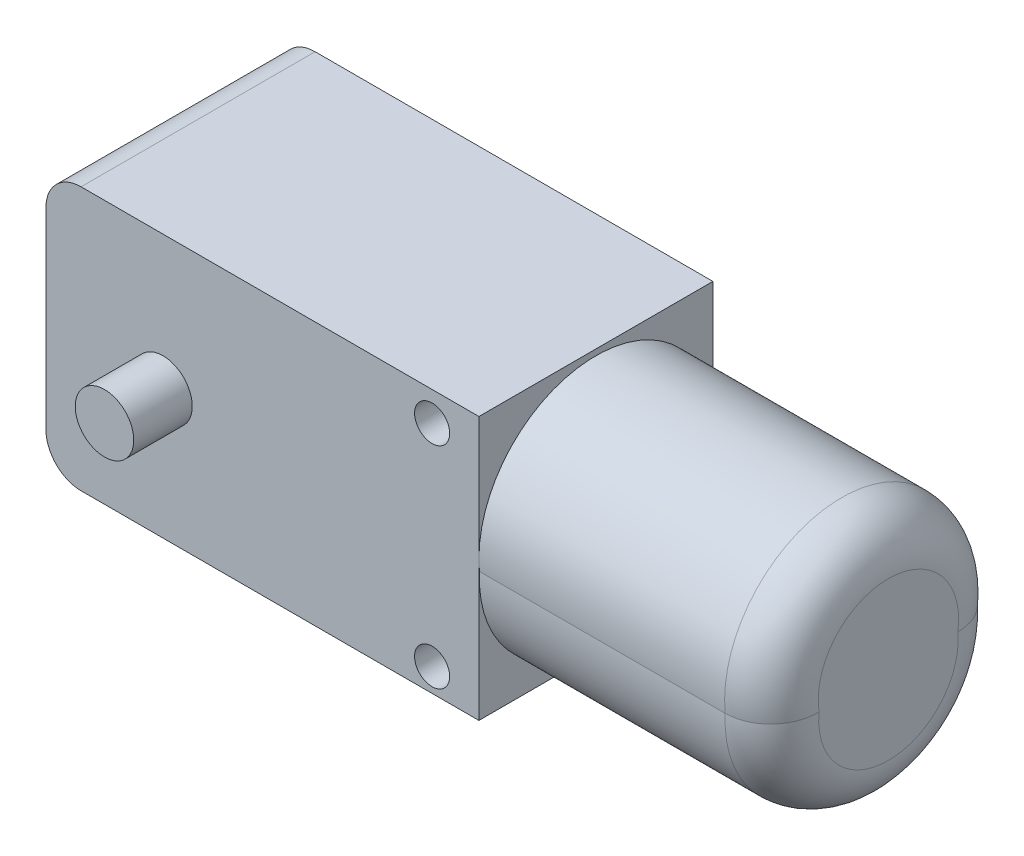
from build123d import *

# Parameters (mm, degrees)
SKETCH1_W           = 37
SKETCH1_H           = 22.5
BOSS_EXTRUDE1_DEPTH = 20
BOSS_EXTRUDE2_DEPTH = 25
SKETCH3_R           = 2.5
BOSS_EXTRUDE3_DEPTH = 5
BOSS_EXTRUDE4_START = 5
SKETCH4_R           = 2.5
BOSS_EXTRUDE4_DEPTH = 5
FILLET1_R           = 3
FILLET2_R           = 4
SKETCH5_W           = 2.75
SKETCH5_H           = 5
BOSS_EXTRUDE5_DEPTH = 5
SKETCH6_R           = 1.5
CUT_EXTRUDE1_DEPTH  = 2.75
SKETCH7_R           = 1.5
CUT_EXTRUDE2_DEPTH  = 78.76577433


with BuildPart() as part:
    # Sketch1 → Boss-Extrude1 (new body)
    with BuildSketch(Plane.XY):
        with Locations((-45.764100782, -13.75)):
            Rectangle(SKETCH1_W, SKETCH1_H)
    extrude(amount=-BOSS_EXTRUDE1_DEPTH)

    # Sketch2 → Boss-Extrude2 (add)
    with BuildSketch(Plane(origin=(-27.264100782, 0, 0), x_dir=(0, 0, -1), z_dir=(1, 0, 0))):
        with BuildLine():
            ThreePointArc((0.050125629, -14), (10, -24.462429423), (19.949874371, -14))
            ThreePointArc((19.949874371, -14), (10, -3), (0.050125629, -14))
        make_face()
    extrude(amount=BOSS_EXTRUDE2_DEPTH)

    # Sketch3 → Boss-Extrude3 (add)
    with BuildSketch(Plane.XY):
        with Locations((-54.264100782, -14)):
            Circle(SKETCH3_R)
    extrude(amount=BOSS_EXTRUDE3_DEPTH)

    # Sketch4 → Boss-Extrude4 (add)
    with BuildSketch(Plane(origin=(0, 0, -20), x_dir=(-1, 0, 0), z_dir=(0, 0, -1)).offset(BOSS_EXTRUDE4_START)):
        with Locations(Location((54.264100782, -14, 0), (0, 0, 180))):
            Circle(SKETCH4_R)
    extrude(amount=-BOSS_EXTRUDE4_DEPTH)

    # Fillet1
    fillet1_edges = [part.edges().sort_by_distance(p)[0] for p in [
        (-64.264100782, -2.5, -10),
        (-64.264100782, -25, -10),
    ]]
    fillet(fillet1_edges, radius=FILLET1_R)

    # Fillet2
    fillet2_edges = [part.edges().sort_by_distance(p)[0] for p in [
        (-2.264100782, -3, -10),
        (-2.264100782, -24.462429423, -10),
    ]]
    fillet(fillet2_edges, radius=FILLET2_R)

    # Sketch5 → Boss-Extrude5 (add)
    with BuildSketch(Plane.ZY.offset(64.264100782)):
        with Locations((-10, -13.75)):
            Rectangle(SKETCH5_W, SKETCH5_H)
    extrude(amount=BOSS_EXTRUDE5_DEPTH)

    # Sketch6 → Cut-Extrude1 (cut)
    with BuildSketch(Plane(origin=(0, 0, -11.375), x_dir=(-1, 0, 0), z_dir=(0, 0, -1))):
        with Locations((66.764100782, -13.75)):
            Circle(SKETCH6_R)
    extrude(amount=-CUT_EXTRUDE1_DEPTH, mode=Mode.SUBTRACT)

    # Sketch7 → Cut-Extrude2 (cut, through all)
    with BuildSketch(Plane(origin=(0, 0, -20), x_dir=(-1, 0, 0), z_dir=(0, 0, -1))):
        with Locations((31.264100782, -5)):
            Circle(SKETCH7_R)
        with Locations((31.264100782, -23)):
            Circle(SKETCH7_R)
    extrude(amount=-CUT_EXTRUDE2_DEPTH, mode=Mode.SUBTRACT)


solid = part.part
